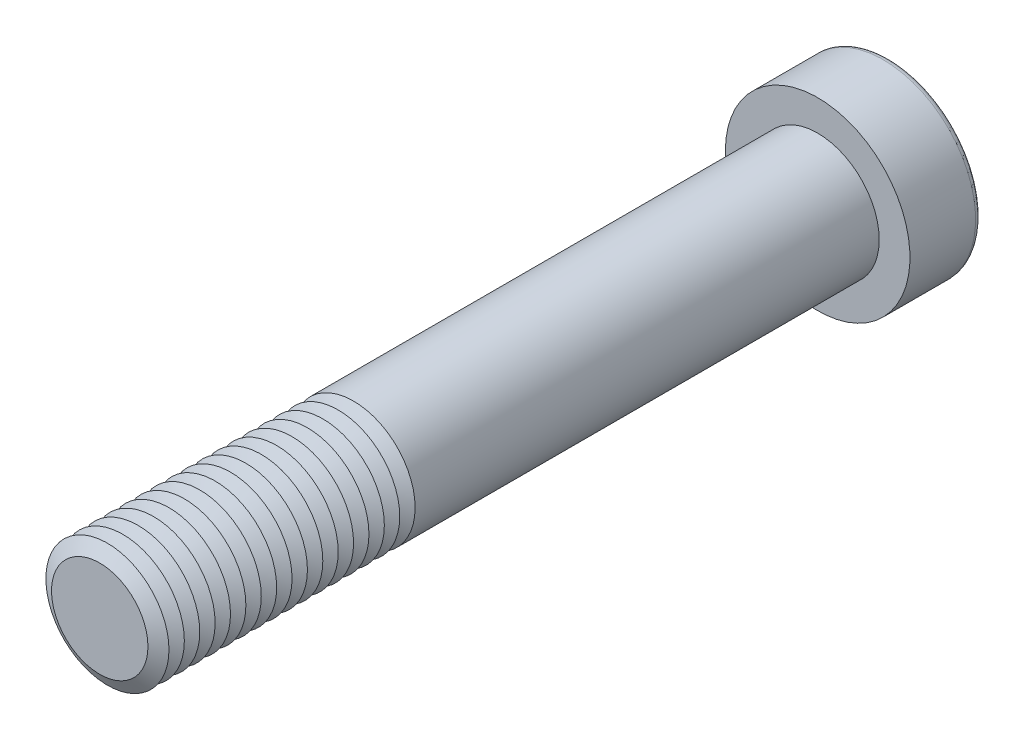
ISO-10303-21;
HEADER;
FILE_DESCRIPTION(('STEP AP214'),'2;1');
FILE_NAME('part.step','',(''),(''),'','','');
FILE_SCHEMA(('AUTOMOTIVE_DESIGN { 1 0 10303 214 1 1 1 1 }'));
ENDSEC;
DATA;
#1=APPLICATION_CONTEXT('core data for automotive mechanical design processes');
#2=APPLICATION_PROTOCOL_DEFINITION('international standard','automotive_design',2000,#1);
#3=PRODUCT_CONTEXT('',#1,'mechanical');
#4=PRODUCT('Part','Part','',(#3));
#5=PRODUCT_RELATED_PRODUCT_CATEGORY('part','',(#4));
#6=PRODUCT_DEFINITION_FORMATION('','',#4);
#7=PRODUCT_DEFINITION_CONTEXT('part definition',#1,'design');
#8=PRODUCT_DEFINITION('design','',#6,#7);
#9=PRODUCT_DEFINITION_SHAPE('','',#8);
#10=(LENGTH_UNIT() NAMED_UNIT(*) SI_UNIT(.MILLI.,.METRE.));
#11=(NAMED_UNIT(*) PLANE_ANGLE_UNIT() SI_UNIT($,.RADIAN.));
#12=(NAMED_UNIT(*) SI_UNIT($,.STERADIAN.) SOLID_ANGLE_UNIT());
#13=UNCERTAINTY_MEASURE_WITH_UNIT(LENGTH_MEASURE(1.E-05),#10,'distance_accuracy_value','');
#14=(GEOMETRIC_REPRESENTATION_CONTEXT(3) GLOBAL_UNCERTAINTY_ASSIGNED_CONTEXT((#13)) GLOBAL_UNIT_ASSIGNED_CONTEXT((#10,
#11,#12)) REPRESENTATION_CONTEXT('',''));
#15=CARTESIAN_POINT('',(0.,0.,0.));
#16=DIRECTION('',(0.,0.,1.));
#17=DIRECTION('',(1.,0.,0.));
#18=AXIS2_PLACEMENT_3D('',#15,#16,#17);
#19=CARTESIAN_POINT('',(0.,0.,129.5));
#20=DIRECTION('',(0.,0.,1.));
#21=DIRECTION('',(1.,0.,0.));
#22=AXIS2_PLACEMENT_3D('',#19,#20,#21);
#23=CONICAL_SURFACE('',#22,12.,1.0471975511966);
#24=CARTESIAN_POINT('',(0.,0.,128.));
#25=DIRECTION('',(0.,0.,1.));
#26=DIRECTION('',(1.,0.,0.));
#27=AXIS2_PLACEMENT_3D('',#24,#25,#26);
#28=CIRCLE('',#27,9.40192378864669);
#29=CARTESIAN_POINT('',(9.40192378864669,0.,128.));
#30=VERTEX_POINT('',#29);
#31=EDGE_CURVE('E313',#30,#30,#28,.T.);
#32=ORIENTED_EDGE('',*,*,#31,.T.);
#33=EDGE_LOOP('',(#32));
#34=FACE_BOUND('',#33,.T.);
#35=CARTESIAN_POINT('',(0.,0.,129.5));
#36=DIRECTION('',(0.,0.,1.));
#37=DIRECTION('',(1.,0.,0.));
#38=AXIS2_PLACEMENT_3D('',#35,#36,#37);
#39=CIRCLE('',#38,12.);
#40=CARTESIAN_POINT('',(12.,0.,129.5));
#41=VERTEX_POINT('',#40);
#42=EDGE_CURVE('E316',#41,#41,#39,.T.);
#43=ORIENTED_EDGE('',*,*,#42,.F.);
#44=EDGE_LOOP('',(#43));
#45=FACE_BOUND('',#44,.T.);
#46=ADVANCED_FACE('F39',(#34,#45),#23,.T.);
#47=CARTESIAN_POINT('',(0.,0.,128.));
#48=DIRECTION('',(0.,0.,-1.));
#49=DIRECTION('',(-1.,0.,0.));
#50=AXIS2_PLACEMENT_3D('',#47,#48,#49);
#51=CONICAL_SURFACE('',#50,9.40192378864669,1.0471975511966);
#52=CARTESIAN_POINT('',(0.,0.,126.5));
#53=DIRECTION('',(0.,0.,1.));
#54=DIRECTION('',(1.,0.,0.));
#55=AXIS2_PLACEMENT_3D('',#52,#53,#54);
#56=CIRCLE('',#55,12.);
#57=CARTESIAN_POINT('',(12.,0.,126.5));
#58=VERTEX_POINT('',#57);
#59=EDGE_CURVE('E324',#58,#58,#56,.T.);
#60=ORIENTED_EDGE('',*,*,#59,.T.);
#61=EDGE_LOOP('',(#60));
#62=FACE_BOUND('',#61,.T.);
#63=ORIENTED_EDGE('',*,*,#31,.F.);
#64=EDGE_LOOP('',(#63));
#65=FACE_BOUND('',#64,.T.);
#66=ADVANCED_FACE('F245',(#62,#65),#51,.T.);
#67=CARTESIAN_POINT('',(0.,0.,140.));
#68=DIRECTION('',(0.,0.,1.));
#69=DIRECTION('',(1.,0.,0.));
#70=AXIS2_PLACEMENT_3D('',#67,#68,#69);
#71=PLANE('',#70);
#72=CARTESIAN_POINT('',(0.,0.,140.));
#73=DIRECTION('',(0.,0.,1.));
#74=DIRECTION('',(1.,0.,0.));
#75=AXIS2_PLACEMENT_3D('',#72,#73,#74);
#76=CIRCLE('',#75,9.40192378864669);
#77=CARTESIAN_POINT('',(9.40192378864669,0.,140.));
#78=VERTEX_POINT('',#77);
#79=EDGE_CURVE('E174',#78,#78,#76,.T.);
#80=ORIENTED_EDGE('',*,*,#79,.T.);
#81=EDGE_LOOP('',(#80));
#82=FACE_BOUND('',#81,.T.);
#83=ADVANCED_FACE('F251',(#82),#71,.T.);
#84=CARTESIAN_POINT('',(0.,0.,140.));
#85=DIRECTION('',(0.,0.,-1.));
#86=DIRECTION('',(-1.,0.,0.));
#87=AXIS2_PLACEMENT_3D('',#84,#85,#86);
#88=CONICAL_SURFACE('',#87,9.40192378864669,1.0471975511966);
#89=CARTESIAN_POINT('',(0.,0.,138.5));
#90=DIRECTION('',(0.,0.,1.));
#91=DIRECTION('',(1.,0.,0.));
#92=AXIS2_PLACEMENT_3D('',#89,#90,#91);
#93=CIRCLE('',#92,12.);
#94=CARTESIAN_POINT('',(12.,0.,138.5));
#95=VERTEX_POINT('',#94);
#96=EDGE_CURVE('E291',#95,#95,#93,.T.);
#97=ORIENTED_EDGE('',*,*,#96,.T.);
#98=EDGE_LOOP('',(#97));
#99=FACE_BOUND('',#98,.T.);
#100=ORIENTED_EDGE('',*,*,#79,.F.);
#101=EDGE_LOOP('',(#100));
#102=FACE_BOUND('',#101,.T.);
#103=ADVANCED_FACE('F199',(#99,#102),#88,.T.);
#104=CARTESIAN_POINT('',(0.,0.,138.5));
#105=DIRECTION('',(0.,0.,1.));
#106=DIRECTION('',(1.,0.,0.));
#107=AXIS2_PLACEMENT_3D('',#104,#105,#106);
#108=CONICAL_SURFACE('',#107,12.,1.0471975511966);
#109=CARTESIAN_POINT('',(0.,0.,137.));
#110=DIRECTION('',(0.,0.,1.));
#111=DIRECTION('',(1.,0.,0.));
#112=AXIS2_PLACEMENT_3D('',#109,#110,#111);
#113=CIRCLE('',#112,9.40192378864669);
#114=CARTESIAN_POINT('',(9.40192378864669,0.,137.));
#115=VERTEX_POINT('',#114);
#116=EDGE_CURVE('E288',#115,#115,#113,.T.);
#117=ORIENTED_EDGE('',*,*,#116,.T.);
#118=EDGE_LOOP('',(#117));
#119=FACE_BOUND('',#118,.T.);
#120=ORIENTED_EDGE('',*,*,#96,.F.);
#121=EDGE_LOOP('',(#120));
#122=FACE_BOUND('',#121,.T.);
#123=ADVANCED_FACE('F277',(#119,#122),#108,.T.);
#124=CARTESIAN_POINT('',(0.,0.,137.));
#125=DIRECTION('',(0.,0.,-1.));
#126=DIRECTION('',(-1.,0.,0.));
#127=AXIS2_PLACEMENT_3D('',#124,#125,#126);
#128=CONICAL_SURFACE('',#127,9.40192378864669,1.0471975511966);
#129=CARTESIAN_POINT('',(0.,0.,135.5));
#130=DIRECTION('',(0.,0.,1.));
#131=DIRECTION('',(1.,0.,0.));
#132=AXIS2_PLACEMENT_3D('',#129,#130,#131);
#133=CIRCLE('',#132,12.);
#134=CARTESIAN_POINT('',(12.,0.,135.5));
#135=VERTEX_POINT('',#134);
#136=EDGE_CURVE('E299',#135,#135,#133,.T.);
#137=ORIENTED_EDGE('',*,*,#136,.T.);
#138=EDGE_LOOP('',(#137));
#139=FACE_BOUND('',#138,.T.);
#140=ORIENTED_EDGE('',*,*,#116,.F.);
#141=EDGE_LOOP('',(#140));
#142=FACE_BOUND('',#141,.T.);
#143=ADVANCED_FACE('F274',(#139,#142),#128,.T.);
#144=CARTESIAN_POINT('',(0.,0.,135.5));
#145=DIRECTION('',(0.,0.,1.));
#146=DIRECTION('',(1.,0.,0.));
#147=AXIS2_PLACEMENT_3D('',#144,#145,#146);
#148=CONICAL_SURFACE('',#147,12.,1.0471975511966);
#149=CARTESIAN_POINT('',(0.,0.,134.));
#150=DIRECTION('',(0.,0.,1.));
#151=DIRECTION('',(1.,0.,0.));
#152=AXIS2_PLACEMENT_3D('',#149,#150,#151);
#153=CIRCLE('',#152,9.40192378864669);
#154=CARTESIAN_POINT('',(9.40192378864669,0.,134.));
#155=VERTEX_POINT('',#154);
#156=EDGE_CURVE('E293',#155,#155,#153,.T.);
#157=ORIENTED_EDGE('',*,*,#156,.T.);
#158=EDGE_LOOP('',(#157));
#159=FACE_BOUND('',#158,.T.);
#160=ORIENTED_EDGE('',*,*,#136,.F.);
#161=EDGE_LOOP('',(#160));
#162=FACE_BOUND('',#161,.T.);
#163=ADVANCED_FACE('F270',(#159,#162),#148,.T.);
#164=CARTESIAN_POINT('',(0.,0.,134.));
#165=DIRECTION('',(0.,0.,-1.));
#166=DIRECTION('',(-1.,0.,0.));
#167=AXIS2_PLACEMENT_3D('',#164,#165,#166);
#168=CONICAL_SURFACE('',#167,9.40192378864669,1.0471975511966);
#169=CARTESIAN_POINT('',(0.,0.,132.5));
#170=DIRECTION('',(0.,0.,1.));
#171=DIRECTION('',(1.,0.,0.));
#172=AXIS2_PLACEMENT_3D('',#169,#170,#171);
#173=CIRCLE('',#172,12.);
#174=CARTESIAN_POINT('',(12.,0.,132.5));
#175=VERTEX_POINT('',#174);
#176=EDGE_CURVE('E309',#175,#175,#173,.T.);
#177=ORIENTED_EDGE('',*,*,#176,.T.);
#178=EDGE_LOOP('',(#177));
#179=FACE_BOUND('',#178,.T.);
#180=ORIENTED_EDGE('',*,*,#156,.F.);
#181=EDGE_LOOP('',(#180));
#182=FACE_BOUND('',#181,.T.);
#183=ADVANCED_FACE('F266',(#179,#182),#168,.T.);
#184=CARTESIAN_POINT('',(0.,0.,132.5));
#185=DIRECTION('',(0.,0.,1.));
#186=DIRECTION('',(1.,0.,0.));
#187=AXIS2_PLACEMENT_3D('',#184,#185,#186);
#188=CONICAL_SURFACE('',#187,12.,1.0471975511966);
#189=CARTESIAN_POINT('',(0.,0.,131.));
#190=DIRECTION('',(0.,0.,1.));
#191=DIRECTION('',(1.,0.,0.));
#192=AXIS2_PLACEMENT_3D('',#189,#190,#191);
#193=CIRCLE('',#192,9.40192378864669);
#194=CARTESIAN_POINT('',(9.40192378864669,0.,131.));
#195=VERTEX_POINT('',#194);
#196=EDGE_CURVE('E305',#195,#195,#193,.T.);
#197=ORIENTED_EDGE('',*,*,#196,.T.);
#198=EDGE_LOOP('',(#197));
#199=FACE_BOUND('',#198,.T.);
#200=ORIENTED_EDGE('',*,*,#176,.F.);
#201=EDGE_LOOP('',(#200));
#202=FACE_BOUND('',#201,.T.);
#203=ADVANCED_FACE('F262',(#199,#202),#188,.T.);
#204=CARTESIAN_POINT('',(0.,0.,131.));
#205=DIRECTION('',(0.,0.,-1.));
#206=DIRECTION('',(-1.,0.,0.));
#207=AXIS2_PLACEMENT_3D('',#204,#205,#206);
#208=CONICAL_SURFACE('',#207,9.40192378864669,1.0471975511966);
#209=ORIENTED_EDGE('',*,*,#42,.T.);
#210=EDGE_LOOP('',(#209));
#211=FACE_BOUND('',#210,.T.);
#212=ORIENTED_EDGE('',*,*,#196,.F.);
#213=EDGE_LOOP('',(#212));
#214=FACE_BOUND('',#213,.T.);
#215=ADVANCED_FACE('F258',(#211,#214),#208,.T.);
#216=CARTESIAN_POINT('',(0.,0.,126.5));
#217=DIRECTION('',(0.,0.,1.));
#218=DIRECTION('',(1.,0.,0.));
#219=AXIS2_PLACEMENT_3D('',#216,#217,#218);
#220=CONICAL_SURFACE('',#219,12.,1.0471975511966);
#221=CARTESIAN_POINT('',(0.,0.,125.));
#222=DIRECTION('',(0.,0.,1.));
#223=DIRECTION('',(1.,0.,0.));
#224=AXIS2_PLACEMENT_3D('',#221,#222,#223);
#225=CIRCLE('',#224,9.40192378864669);
#226=CARTESIAN_POINT('',(9.40192378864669,0.,125.));
#227=VERTEX_POINT('',#226);
#228=EDGE_CURVE('E320',#227,#227,#225,.T.);
#229=ORIENTED_EDGE('',*,*,#228,.T.);
#230=EDGE_LOOP('',(#229));
#231=FACE_BOUND('',#230,.T.);
#232=ORIENTED_EDGE('',*,*,#59,.F.);
#233=EDGE_LOOP('',(#232));
#234=FACE_BOUND('',#233,.T.);
#235=ADVANCED_FACE('F261',(#231,#234),#220,.T.);
#236=CARTESIAN_POINT('',(0.,0.,125.));
#237=DIRECTION('',(0.,0.,-1.));
#238=DIRECTION('',(-1.,0.,0.));
#239=AXIS2_PLACEMENT_3D('',#236,#237,#238);
#240=CONICAL_SURFACE('',#239,9.40192378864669,1.0471975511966);
#241=CARTESIAN_POINT('',(0.,0.,123.5));
#242=DIRECTION('',(0.,0.,1.));
#243=DIRECTION('',(1.,0.,0.));
#244=AXIS2_PLACEMENT_3D('',#241,#242,#243);
#245=CIRCLE('',#244,12.);
#246=CARTESIAN_POINT('',(12.,0.,123.5));
#247=VERTEX_POINT('',#246);
#248=EDGE_CURVE('E332',#247,#247,#245,.T.);
#249=ORIENTED_EDGE('',*,*,#248,.T.);
#250=EDGE_LOOP('',(#249));
#251=FACE_BOUND('',#250,.T.);
#252=ORIENTED_EDGE('',*,*,#228,.F.);
#253=EDGE_LOOP('',(#252));
#254=FACE_BOUND('',#253,.T.);
#255=ADVANCED_FACE('F511',(#251,#254),#240,.T.);
#256=CARTESIAN_POINT('',(0.,0.,123.5));
#257=DIRECTION('',(0.,0.,1.));
#258=DIRECTION('',(1.,0.,0.));
#259=AXIS2_PLACEMENT_3D('',#256,#257,#258);
#260=CONICAL_SURFACE('',#259,12.,1.0471975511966);
#261=CARTESIAN_POINT('',(0.,0.,122.));
#262=DIRECTION('',(0.,0.,1.));
#263=DIRECTION('',(1.,0.,0.));
#264=AXIS2_PLACEMENT_3D('',#261,#262,#263);
#265=CIRCLE('',#264,9.40192378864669);
#266=CARTESIAN_POINT('',(9.40192378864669,0.,122.));
#267=VERTEX_POINT('',#266);
#268=EDGE_CURVE('E328',#267,#267,#265,.T.);
#269=ORIENTED_EDGE('',*,*,#268,.T.);
#270=EDGE_LOOP('',(#269));
#271=FACE_BOUND('',#270,.T.);
#272=ORIENTED_EDGE('',*,*,#248,.F.);
#273=EDGE_LOOP('',(#272));
#274=FACE_BOUND('',#273,.T.);
#275=ADVANCED_FACE('F507',(#271,#274),#260,.T.);
#276=CARTESIAN_POINT('',(0.,0.,122.));
#277=DIRECTION('',(0.,0.,-1.));
#278=DIRECTION('',(-1.,0.,0.));
#279=AXIS2_PLACEMENT_3D('',#276,#277,#278);
#280=CONICAL_SURFACE('',#279,9.40192378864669,1.0471975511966);
#281=CARTESIAN_POINT('',(0.,0.,120.5));
#282=DIRECTION('',(0.,0.,1.));
#283=DIRECTION('',(1.,0.,0.));
#284=AXIS2_PLACEMENT_3D('',#281,#282,#283);
#285=CIRCLE('',#284,12.);
#286=CARTESIAN_POINT('',(12.,0.,120.5));
#287=VERTEX_POINT('',#286);
#288=EDGE_CURVE('E340',#287,#287,#285,.T.);
#289=ORIENTED_EDGE('',*,*,#288,.T.);
#290=EDGE_LOOP('',(#289));
#291=FACE_BOUND('',#290,.T.);
#292=ORIENTED_EDGE('',*,*,#268,.F.);
#293=EDGE_LOOP('',(#292));
#294=FACE_BOUND('',#293,.T.);
#295=ADVANCED_FACE('F503',(#291,#294),#280,.T.);
#296=CARTESIAN_POINT('',(0.,0.,120.5));
#297=DIRECTION('',(0.,0.,1.));
#298=DIRECTION('',(1.,0.,0.));
#299=AXIS2_PLACEMENT_3D('',#296,#297,#298);
#300=CONICAL_SURFACE('',#299,12.,1.0471975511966);
#301=CARTESIAN_POINT('',(0.,0.,119.));
#302=DIRECTION('',(0.,0.,1.));
#303=DIRECTION('',(1.,0.,0.));
#304=AXIS2_PLACEMENT_3D('',#301,#302,#303);
#305=CIRCLE('',#304,9.40192378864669);
#306=CARTESIAN_POINT('',(9.40192378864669,0.,119.));
#307=VERTEX_POINT('',#306);
#308=EDGE_CURVE('E336',#307,#307,#305,.T.);
#309=ORIENTED_EDGE('',*,*,#308,.T.);
#310=EDGE_LOOP('',(#309));
#311=FACE_BOUND('',#310,.T.);
#312=ORIENTED_EDGE('',*,*,#288,.F.);
#313=EDGE_LOOP('',(#312));
#314=FACE_BOUND('',#313,.T.);
#315=ADVANCED_FACE('F499',(#311,#314),#300,.T.);
#316=CARTESIAN_POINT('',(0.,0.,119.));
#317=DIRECTION('',(0.,0.,-1.));
#318=DIRECTION('',(-1.,0.,0.));
#319=AXIS2_PLACEMENT_3D('',#316,#317,#318);
#320=CONICAL_SURFACE('',#319,9.40192378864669,1.0471975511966);
#321=CARTESIAN_POINT('',(0.,0.,117.5));
#322=DIRECTION('',(0.,0.,1.));
#323=DIRECTION('',(1.,0.,0.));
#324=AXIS2_PLACEMENT_3D('',#321,#322,#323);
#325=CIRCLE('',#324,12.);
#326=CARTESIAN_POINT('',(12.,0.,117.5));
#327=VERTEX_POINT('',#326);
#328=EDGE_CURVE('E347',#327,#327,#325,.T.);
#329=ORIENTED_EDGE('',*,*,#328,.T.);
#330=EDGE_LOOP('',(#329));
#331=FACE_BOUND('',#330,.T.);
#332=ORIENTED_EDGE('',*,*,#308,.F.);
#333=EDGE_LOOP('',(#332));
#334=FACE_BOUND('',#333,.T.);
#335=ADVANCED_FACE('F495',(#331,#334),#320,.T.);
#336=CARTESIAN_POINT('',(0.,0.,117.5));
#337=DIRECTION('',(0.,0.,1.));
#338=DIRECTION('',(1.,0.,0.));
#339=AXIS2_PLACEMENT_3D('',#336,#337,#338);
#340=CONICAL_SURFACE('',#339,12.,1.0471975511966);
#341=CARTESIAN_POINT('',(0.,0.,116.));
#342=DIRECTION('',(0.,0.,1.));
#343=DIRECTION('',(1.,0.,0.));
#344=AXIS2_PLACEMENT_3D('',#341,#342,#343);
#345=CIRCLE('',#344,9.40192378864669);
#346=CARTESIAN_POINT('',(9.40192378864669,0.,116.));
#347=VERTEX_POINT('',#346);
#348=EDGE_CURVE('E344',#347,#347,#345,.T.);
#349=ORIENTED_EDGE('',*,*,#348,.T.);
#350=EDGE_LOOP('',(#349));
#351=FACE_BOUND('',#350,.T.);
#352=ORIENTED_EDGE('',*,*,#328,.F.);
#353=EDGE_LOOP('',(#352));
#354=FACE_BOUND('',#353,.T.);
#355=ADVANCED_FACE('F491',(#351,#354),#340,.T.);
#356=CARTESIAN_POINT('',(0.,0.,116.));
#357=DIRECTION('',(0.,0.,-1.));
#358=DIRECTION('',(-1.,0.,0.));
#359=AXIS2_PLACEMENT_3D('',#356,#357,#358);
#360=CONICAL_SURFACE('',#359,9.40192378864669,1.0471975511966);
#361=CARTESIAN_POINT('',(0.,0.,114.5));
#362=DIRECTION('',(0.,0.,1.));
#363=DIRECTION('',(1.,0.,0.));
#364=AXIS2_PLACEMENT_3D('',#361,#362,#363);
#365=CIRCLE('',#364,12.);
#366=CARTESIAN_POINT('',(12.,0.,114.5));
#367=VERTEX_POINT('',#366);
#368=EDGE_CURVE('E354',#367,#367,#365,.T.);
#369=ORIENTED_EDGE('',*,*,#368,.T.);
#370=EDGE_LOOP('',(#369));
#371=FACE_BOUND('',#370,.T.);
#372=ORIENTED_EDGE('',*,*,#348,.F.);
#373=EDGE_LOOP('',(#372));
#374=FACE_BOUND('',#373,.T.);
#375=ADVANCED_FACE('F487',(#371,#374),#360,.T.);
#376=CARTESIAN_POINT('',(0.,0.,114.5));
#377=DIRECTION('',(0.,0.,1.));
#378=DIRECTION('',(1.,0.,0.));
#379=AXIS2_PLACEMENT_3D('',#376,#377,#378);
#380=CONICAL_SURFACE('',#379,12.,1.0471975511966);
#381=CARTESIAN_POINT('',(0.,0.,113.));
#382=DIRECTION('',(0.,0.,1.));
#383=DIRECTION('',(1.,0.,0.));
#384=AXIS2_PLACEMENT_3D('',#381,#382,#383);
#385=CIRCLE('',#384,9.40192378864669);
#386=CARTESIAN_POINT('',(9.40192378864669,0.,113.));
#387=VERTEX_POINT('',#386);
#388=EDGE_CURVE('E350',#387,#387,#385,.T.);
#389=ORIENTED_EDGE('',*,*,#388,.T.);
#390=EDGE_LOOP('',(#389));
#391=FACE_BOUND('',#390,.T.);
#392=ORIENTED_EDGE('',*,*,#368,.F.);
#393=EDGE_LOOP('',(#392));
#394=FACE_BOUND('',#393,.T.);
#395=ADVANCED_FACE('F483',(#391,#394),#380,.T.);
#396=CARTESIAN_POINT('',(0.,0.,113.));
#397=DIRECTION('',(0.,0.,-1.));
#398=DIRECTION('',(-1.,0.,0.));
#399=AXIS2_PLACEMENT_3D('',#396,#397,#398);
#400=CONICAL_SURFACE('',#399,9.40192378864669,1.0471975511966);
#401=CARTESIAN_POINT('',(0.,0.,111.5));
#402=DIRECTION('',(0.,0.,1.));
#403=DIRECTION('',(1.,0.,0.));
#404=AXIS2_PLACEMENT_3D('',#401,#402,#403);
#405=CIRCLE('',#404,12.);
#406=CARTESIAN_POINT('',(12.,0.,111.5));
#407=VERTEX_POINT('',#406);
#408=EDGE_CURVE('E362',#407,#407,#405,.T.);
#409=ORIENTED_EDGE('',*,*,#408,.T.);
#410=EDGE_LOOP('',(#409));
#411=FACE_BOUND('',#410,.T.);
#412=ORIENTED_EDGE('',*,*,#388,.F.);
#413=EDGE_LOOP('',(#412));
#414=FACE_BOUND('',#413,.T.);
#415=ADVANCED_FACE('F479',(#411,#414),#400,.T.);
#416=CARTESIAN_POINT('',(0.,0.,111.5));
#417=DIRECTION('',(0.,0.,1.));
#418=DIRECTION('',(1.,0.,0.));
#419=AXIS2_PLACEMENT_3D('',#416,#417,#418);
#420=CONICAL_SURFACE('',#419,12.,1.0471975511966);
#421=CARTESIAN_POINT('',(0.,0.,110.));
#422=DIRECTION('',(0.,0.,1.));
#423=DIRECTION('',(1.,0.,0.));
#424=AXIS2_PLACEMENT_3D('',#421,#422,#423);
#425=CIRCLE('',#424,9.40192378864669);
#426=CARTESIAN_POINT('',(9.40192378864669,0.,110.));
#427=VERTEX_POINT('',#426);
#428=EDGE_CURVE('E358',#427,#427,#425,.T.);
#429=ORIENTED_EDGE('',*,*,#428,.T.);
#430=EDGE_LOOP('',(#429));
#431=FACE_BOUND('',#430,.T.);
#432=ORIENTED_EDGE('',*,*,#408,.F.);
#433=EDGE_LOOP('',(#432));
#434=FACE_BOUND('',#433,.T.);
#435=ADVANCED_FACE('F475',(#431,#434),#420,.T.);
#436=CARTESIAN_POINT('',(0.,0.,110.));
#437=DIRECTION('',(0.,0.,-1.));
#438=DIRECTION('',(-1.,0.,0.));
#439=AXIS2_PLACEMENT_3D('',#436,#437,#438);
#440=CONICAL_SURFACE('',#439,9.40192378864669,1.0471975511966);
#441=CARTESIAN_POINT('',(0.,0.,108.5));
#442=DIRECTION('',(0.,0.,1.));
#443=DIRECTION('',(1.,0.,0.));
#444=AXIS2_PLACEMENT_3D('',#441,#442,#443);
#445=CIRCLE('',#444,12.);
#446=CARTESIAN_POINT('',(12.,0.,108.5));
#447=VERTEX_POINT('',#446);
#448=EDGE_CURVE('E370',#447,#447,#445,.T.);
#449=ORIENTED_EDGE('',*,*,#448,.T.);
#450=EDGE_LOOP('',(#449));
#451=FACE_BOUND('',#450,.T.);
#452=ORIENTED_EDGE('',*,*,#428,.F.);
#453=EDGE_LOOP('',(#452));
#454=FACE_BOUND('',#453,.T.);
#455=ADVANCED_FACE('F471',(#451,#454),#440,.T.);
#456=CARTESIAN_POINT('',(0.,0.,108.5));
#457=DIRECTION('',(0.,0.,1.));
#458=DIRECTION('',(1.,0.,0.));
#459=AXIS2_PLACEMENT_3D('',#456,#457,#458);
#460=CONICAL_SURFACE('',#459,12.,1.0471975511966);
#461=CARTESIAN_POINT('',(0.,0.,107.));
#462=DIRECTION('',(0.,0.,1.));
#463=DIRECTION('',(1.,0.,0.));
#464=AXIS2_PLACEMENT_3D('',#461,#462,#463);
#465=CIRCLE('',#464,9.40192378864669);
#466=CARTESIAN_POINT('',(9.40192378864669,0.,107.));
#467=VERTEX_POINT('',#466);
#468=EDGE_CURVE('E366',#467,#467,#465,.T.);
#469=ORIENTED_EDGE('',*,*,#468,.T.);
#470=EDGE_LOOP('',(#469));
#471=FACE_BOUND('',#470,.T.);
#472=ORIENTED_EDGE('',*,*,#448,.F.);
#473=EDGE_LOOP('',(#472));
#474=FACE_BOUND('',#473,.T.);
#475=ADVANCED_FACE('F467',(#471,#474),#460,.T.);
#476=CARTESIAN_POINT('',(0.,0.,107.));
#477=DIRECTION('',(0.,0.,-1.));
#478=DIRECTION('',(-1.,0.,0.));
#479=AXIS2_PLACEMENT_3D('',#476,#477,#478);
#480=CONICAL_SURFACE('',#479,9.40192378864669,1.0471975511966);
#481=CARTESIAN_POINT('',(0.,0.,105.5));
#482=DIRECTION('',(0.,0.,1.));
#483=DIRECTION('',(1.,0.,0.));
#484=AXIS2_PLACEMENT_3D('',#481,#482,#483);
#485=CIRCLE('',#484,12.);
#486=CARTESIAN_POINT('',(12.,0.,105.5));
#487=VERTEX_POINT('',#486);
#488=EDGE_CURVE('E378',#487,#487,#485,.T.);
#489=ORIENTED_EDGE('',*,*,#488,.T.);
#490=EDGE_LOOP('',(#489));
#491=FACE_BOUND('',#490,.T.);
#492=ORIENTED_EDGE('',*,*,#468,.F.);
#493=EDGE_LOOP('',(#492));
#494=FACE_BOUND('',#493,.T.);
#495=ADVANCED_FACE('F463',(#491,#494),#480,.T.);
#496=CARTESIAN_POINT('',(0.,0.,105.5));
#497=DIRECTION('',(0.,0.,1.));
#498=DIRECTION('',(1.,0.,0.));
#499=AXIS2_PLACEMENT_3D('',#496,#497,#498);
#500=CONICAL_SURFACE('',#499,12.,1.0471975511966);
#501=CARTESIAN_POINT('',(0.,0.,104.));
#502=DIRECTION('',(0.,0.,1.));
#503=DIRECTION('',(1.,0.,0.));
#504=AXIS2_PLACEMENT_3D('',#501,#502,#503);
#505=CIRCLE('',#504,9.40192378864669);
#506=CARTESIAN_POINT('',(9.40192378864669,0.,104.));
#507=VERTEX_POINT('',#506);
#508=EDGE_CURVE('E374',#507,#507,#505,.T.);
#509=ORIENTED_EDGE('',*,*,#508,.T.);
#510=EDGE_LOOP('',(#509));
#511=FACE_BOUND('',#510,.T.);
#512=ORIENTED_EDGE('',*,*,#488,.F.);
#513=EDGE_LOOP('',(#512));
#514=FACE_BOUND('',#513,.T.);
#515=ADVANCED_FACE('F459',(#511,#514),#500,.T.);
#516=CARTESIAN_POINT('',(0.,0.,104.));
#517=DIRECTION('',(0.,0.,-1.));
#518=DIRECTION('',(-1.,0.,0.));
#519=AXIS2_PLACEMENT_3D('',#516,#517,#518);
#520=CONICAL_SURFACE('',#519,9.40192378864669,1.0471975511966);
#521=CARTESIAN_POINT('',(0.,0.,102.5));
#522=DIRECTION('',(0.,0.,1.));
#523=DIRECTION('',(1.,0.,0.));
#524=AXIS2_PLACEMENT_3D('',#521,#522,#523);
#525=CIRCLE('',#524,12.);
#526=CARTESIAN_POINT('',(12.,0.,102.5));
#527=VERTEX_POINT('',#526);
#528=EDGE_CURVE('E386',#527,#527,#525,.T.);
#529=ORIENTED_EDGE('',*,*,#528,.T.);
#530=EDGE_LOOP('',(#529));
#531=FACE_BOUND('',#530,.T.);
#532=ORIENTED_EDGE('',*,*,#508,.F.);
#533=EDGE_LOOP('',(#532));
#534=FACE_BOUND('',#533,.T.);
#535=ADVANCED_FACE('F455',(#531,#534),#520,.T.);
#536=CARTESIAN_POINT('',(0.,0.,102.5));
#537=DIRECTION('',(0.,0.,1.));
#538=DIRECTION('',(1.,0.,0.));
#539=AXIS2_PLACEMENT_3D('',#536,#537,#538);
#540=CONICAL_SURFACE('',#539,12.,1.0471975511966);
#541=CARTESIAN_POINT('',(0.,0.,101.));
#542=DIRECTION('',(0.,0.,1.));
#543=DIRECTION('',(1.,0.,0.));
#544=AXIS2_PLACEMENT_3D('',#541,#542,#543);
#545=CIRCLE('',#544,9.40192378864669);
#546=CARTESIAN_POINT('',(9.40192378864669,0.,101.));
#547=VERTEX_POINT('',#546);
#548=EDGE_CURVE('E382',#547,#547,#545,.T.);
#549=ORIENTED_EDGE('',*,*,#548,.T.);
#550=EDGE_LOOP('',(#549));
#551=FACE_BOUND('',#550,.T.);
#552=ORIENTED_EDGE('',*,*,#528,.F.);
#553=EDGE_LOOP('',(#552));
#554=FACE_BOUND('',#553,.T.);
#555=ADVANCED_FACE('F451',(#551,#554),#540,.T.);
#556=CARTESIAN_POINT('',(0.,0.,101.));
#557=DIRECTION('',(0.,0.,-1.));
#558=DIRECTION('',(-1.,0.,0.));
#559=AXIS2_PLACEMENT_3D('',#556,#557,#558);
#560=CONICAL_SURFACE('',#559,9.40192378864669,1.0471975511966);
#561=CARTESIAN_POINT('',(0.,0.,99.5));
#562=DIRECTION('',(0.,0.,1.));
#563=DIRECTION('',(1.,0.,0.));
#564=AXIS2_PLACEMENT_3D('',#561,#562,#563);
#565=CIRCLE('',#564,12.);
#566=CARTESIAN_POINT('',(12.,0.,99.5));
#567=VERTEX_POINT('',#566);
#568=EDGE_CURVE('E394',#567,#567,#565,.T.);
#569=ORIENTED_EDGE('',*,*,#568,.T.);
#570=EDGE_LOOP('',(#569));
#571=FACE_BOUND('',#570,.T.);
#572=ORIENTED_EDGE('',*,*,#548,.F.);
#573=EDGE_LOOP('',(#572));
#574=FACE_BOUND('',#573,.T.);
#575=ADVANCED_FACE('F447',(#571,#574),#560,.T.);
#576=CARTESIAN_POINT('',(0.,0.,99.5));
#577=DIRECTION('',(0.,0.,1.));
#578=DIRECTION('',(1.,0.,0.));
#579=AXIS2_PLACEMENT_3D('',#576,#577,#578);
#580=CONICAL_SURFACE('',#579,12.,1.0471975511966);
#581=CARTESIAN_POINT('',(0.,0.,98.));
#582=DIRECTION('',(0.,0.,1.));
#583=DIRECTION('',(1.,0.,0.));
#584=AXIS2_PLACEMENT_3D('',#581,#582,#583);
#585=CIRCLE('',#584,9.40192378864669);
#586=CARTESIAN_POINT('',(9.40192378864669,0.,98.));
#587=VERTEX_POINT('',#586);
#588=EDGE_CURVE('E390',#587,#587,#585,.T.);
#589=ORIENTED_EDGE('',*,*,#588,.T.);
#590=EDGE_LOOP('',(#589));
#591=FACE_BOUND('',#590,.T.);
#592=ORIENTED_EDGE('',*,*,#568,.F.);
#593=EDGE_LOOP('',(#592));
#594=FACE_BOUND('',#593,.T.);
#595=ADVANCED_FACE('F443',(#591,#594),#580,.T.);
#596=CARTESIAN_POINT('',(0.,0.,98.));
#597=DIRECTION('',(0.,0.,-1.));
#598=DIRECTION('',(-1.,0.,0.));
#599=AXIS2_PLACEMENT_3D('',#596,#597,#598);
#600=CONICAL_SURFACE('',#599,9.40192378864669,1.0471975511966);
#601=CARTESIAN_POINT('',(0.,0.,96.5));
#602=DIRECTION('',(0.,0.,1.));
#603=DIRECTION('',(1.,0.,0.));
#604=AXIS2_PLACEMENT_3D('',#601,#602,#603);
#605=CIRCLE('',#604,12.);
#606=CARTESIAN_POINT('',(12.,0.,96.5));
#607=VERTEX_POINT('',#606);
#608=EDGE_CURVE('E402',#607,#607,#605,.T.);
#609=ORIENTED_EDGE('',*,*,#608,.T.);
#610=EDGE_LOOP('',(#609));
#611=FACE_BOUND('',#610,.T.);
#612=ORIENTED_EDGE('',*,*,#588,.F.);
#613=EDGE_LOOP('',(#612));
#614=FACE_BOUND('',#613,.T.);
#615=ADVANCED_FACE('F439',(#611,#614),#600,.T.);
#616=CARTESIAN_POINT('',(0.,0.,96.5));
#617=DIRECTION('',(0.,0.,1.));
#618=DIRECTION('',(1.,0.,0.));
#619=AXIS2_PLACEMENT_3D('',#616,#617,#618);
#620=CONICAL_SURFACE('',#619,12.,1.0471975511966);
#621=CARTESIAN_POINT('',(0.,0.,95.));
#622=DIRECTION('',(0.,0.,1.));
#623=DIRECTION('',(1.,0.,0.));
#624=AXIS2_PLACEMENT_3D('',#621,#622,#623);
#625=CIRCLE('',#624,9.40192378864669);
#626=CARTESIAN_POINT('',(9.40192378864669,0.,95.));
#627=VERTEX_POINT('',#626);
#628=EDGE_CURVE('E398',#627,#627,#625,.T.);
#629=ORIENTED_EDGE('',*,*,#628,.T.);
#630=EDGE_LOOP('',(#629));
#631=FACE_BOUND('',#630,.T.);
#632=ORIENTED_EDGE('',*,*,#608,.F.);
#633=EDGE_LOOP('',(#632));
#634=FACE_BOUND('',#633,.T.);
#635=ADVANCED_FACE('F434',(#631,#634),#620,.T.);
#636=CARTESIAN_POINT('',(0.,0.,95.));
#637=DIRECTION('',(0.,0.,-1.));
#638=DIRECTION('',(-1.,0.,0.));
#639=AXIS2_PLACEMENT_3D('',#636,#637,#638);
#640=CONICAL_SURFACE('',#639,9.40192378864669,1.0471975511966);
#641=CARTESIAN_POINT('',(0.,0.,93.5));
#642=DIRECTION('',(0.,0.,1.));
#643=DIRECTION('',(1.,0.,0.));
#644=AXIS2_PLACEMENT_3D('',#641,#642,#643);
#645=CIRCLE('',#644,12.);
#646=CARTESIAN_POINT('',(12.,0.,93.5));
#647=VERTEX_POINT('',#646);
#648=EDGE_CURVE('E414',#647,#647,#645,.T.);
#649=ORIENTED_EDGE('',*,*,#648,.T.);
#650=EDGE_LOOP('',(#649));
#651=FACE_BOUND('',#650,.T.);
#652=ORIENTED_EDGE('',*,*,#628,.F.);
#653=EDGE_LOOP('',(#652));
#654=FACE_BOUND('',#653,.T.);
#655=ADVANCED_FACE('F420',(#651,#654),#640,.T.);
#656=CARTESIAN_POINT('',(0.,0.,93.5));
#657=DIRECTION('',(0.,0.,1.));
#658=DIRECTION('',(1.,0.,0.));
#659=AXIS2_PLACEMENT_3D('',#656,#657,#658);
#660=CONICAL_SURFACE('',#659,12.,1.0471975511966);
#661=CARTESIAN_POINT('',(0.,0.,92.));
#662=DIRECTION('',(0.,0.,1.));
#663=DIRECTION('',(1.,0.,0.));
#664=AXIS2_PLACEMENT_3D('',#661,#662,#663);
#665=CIRCLE('',#664,9.40192378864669);
#666=CARTESIAN_POINT('',(9.40192378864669,0.,92.));
#667=VERTEX_POINT('',#666);
#668=EDGE_CURVE('E406',#667,#667,#665,.T.);
#669=ORIENTED_EDGE('',*,*,#668,.T.);
#670=EDGE_LOOP('',(#669));
#671=FACE_BOUND('',#670,.T.);
#672=ORIENTED_EDGE('',*,*,#648,.F.);
#673=EDGE_LOOP('',(#672));
#674=FACE_BOUND('',#673,.T.);
#675=ADVANCED_FACE('F423',(#671,#674),#660,.T.);
#676=CARTESIAN_POINT('',(0.,0.,92.));
#677=DIRECTION('',(0.,0.,-1.));
#678=DIRECTION('',(-1.,0.,0.));
#679=AXIS2_PLACEMENT_3D('',#676,#677,#678);
#680=CONICAL_SURFACE('',#679,9.40192378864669,1.0471975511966);
#681=CARTESIAN_POINT('',(0.,0.,90.5));
#682=DIRECTION('',(0.,0.,1.));
#683=DIRECTION('',(1.,0.,0.));
#684=AXIS2_PLACEMENT_3D('',#681,#682,#683);
#685=CIRCLE('',#684,12.);
#686=CARTESIAN_POINT('',(12.,0.,90.5));
#687=VERTEX_POINT('',#686);
#688=EDGE_CURVE('E410',#687,#687,#685,.T.);
#689=ORIENTED_EDGE('',*,*,#688,.T.);
#690=EDGE_LOOP('',(#689));
#691=FACE_BOUND('',#690,.T.);
#692=ORIENTED_EDGE('',*,*,#668,.F.);
#693=EDGE_LOOP('',(#692));
#694=FACE_BOUND('',#693,.T.);
#695=ADVANCED_FACE('F425',(#691,#694),#680,.T.);
#696=CARTESIAN_POINT('',(0.,0.,0.25));
#697=DIRECTION('',(0.,0.,-1.));
#698=DIRECTION('',(-1.,0.,0.));
#699=AXIS2_PLACEMENT_3D('',#696,#697,#698);
#700=CONICAL_SURFACE('',#699,9.5,1.0471975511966);
#701=CARTESIAN_POINT('',(0.,0.,5.73482755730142));
#702=VERTEX_POINT('',#701);
#703=VERTEX_LOOP('',#702);
#704=FACE_BOUND('',#703,.T.);
#705=CARTESIAN_POINT('',(0.,0.,0.25));
#706=DIRECTION('',(0.,0.,-1.));
#707=DIRECTION('',(-1.,0.,0.));
#708=AXIS2_PLACEMENT_3D('',#705,#706,#707);
#709=CIRCLE('',#708,9.5);
#710=CARTESIAN_POINT('',(-8.22724133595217,4.75,0.25));
#711=VERTEX_POINT('',#710);
#712=CARTESIAN_POINT('',(0.,9.5,0.25));
#713=VERTEX_POINT('',#712);
#714=EDGE_CURVE('E149',#711,#713,#709,.T.);
#715=ORIENTED_EDGE('',*,*,#714,.T.);
#716=CARTESIAN_POINT('',(0.,0.,0.25));
#717=DIRECTION('',(0.,0.,-1.));
#718=DIRECTION('',(-1.,0.,0.));
#719=AXIS2_PLACEMENT_3D('',#716,#717,#718);
#720=CIRCLE('',#719,9.5);
#721=CARTESIAN_POINT('',(8.22724133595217,4.75,0.25));
#722=VERTEX_POINT('',#721);
#723=EDGE_CURVE('E54',#713,#722,#720,.T.);
#724=ORIENTED_EDGE('',*,*,#723,.T.);
#725=CARTESIAN_POINT('',(8.22724133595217,-4.75,0.25));
#726=VERTEX_POINT('',#725);
#727=EDGE_CURVE('E1026',#722,#726,#720,.T.);
#728=ORIENTED_EDGE('',*,*,#727,.T.);
#729=CARTESIAN_POINT('',(0.,-9.5,0.25));
#730=VERTEX_POINT('',#729);
#731=EDGE_CURVE('E1024',#726,#730,#720,.T.);
#732=ORIENTED_EDGE('',*,*,#731,.T.);
#733=CARTESIAN_POINT('',(-8.22724133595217,-4.75,0.25));
#734=VERTEX_POINT('',#733);
#735=EDGE_CURVE('E1018',#730,#734,#720,.T.);
#736=ORIENTED_EDGE('',*,*,#735,.T.);
#737=EDGE_CURVE('E1016',#734,#711,#720,.T.);
#738=ORIENTED_EDGE('',*,*,#737,.T.);
#739=EDGE_LOOP('',(#715,#724,#728,#732,#736,#738));
#740=FACE_BOUND('',#739,.T.);
#741=ADVANCED_FACE('F201',(#704,#740),#700,.F.);
#742=CARTESIAN_POINT('',(0.,0.,0.25));
#743=DIRECTION('',(0.,0.,-1.));
#744=DIRECTION('',(-1.,0.,0.));
#745=AXIS2_PLACEMENT_3D('',#742,#743,#744);
#746=PLANE('',#745);
#747=ORIENTED_EDGE('',*,*,#723,.F.);
#748=DIRECTION('',(1.,0.,0.));
#749=VECTOR('',#748,1.);
#750=CARTESIAN_POINT('',(-5.48482755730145,9.5,0.25));
#751=LINE('',#750,#749);
#752=CARTESIAN_POINT('',(5.48482755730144,9.5,0.25));
#753=VERTEX_POINT('',#752);
#754=EDGE_CURVE('E1069',#713,#753,#751,.T.);
#755=ORIENTED_EDGE('',*,*,#754,.T.);
#756=DIRECTION('',(0.5,-0.866025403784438,0.));
#757=VECTOR('',#756,1.);
#758=CARTESIAN_POINT('',(5.48482755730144,9.5,0.25));
#759=LINE('',#758,#757);
#760=EDGE_CURVE('E155',#753,#722,#759,.T.);
#761=ORIENTED_EDGE('',*,*,#760,.T.);
#762=EDGE_LOOP('',(#747,#755,#761));
#763=FACE_BOUND('',#762,.T.);
#764=ADVANCED_FACE('F606',(#763),#746,.T.);
#765=ORIENTED_EDGE('',*,*,#727,.F.);
#766=CARTESIAN_POINT('',(10.9696551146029,0.,0.25));
#767=VERTEX_POINT('',#766);
#768=EDGE_CURVE('E1063',#722,#767,#759,.T.);
#769=ORIENTED_EDGE('',*,*,#768,.T.);
#770=DIRECTION('',(-0.5,-0.866025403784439,0.));
#771=VECTOR('',#770,1.);
#772=CARTESIAN_POINT('',(10.9696551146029,0.,0.25));
#773=LINE('',#772,#771);
#774=EDGE_CURVE('E1039',#767,#726,#773,.T.);
#775=ORIENTED_EDGE('',*,*,#774,.T.);
#776=EDGE_LOOP('',(#765,#769,#775));
#777=FACE_BOUND('',#776,.T.);
#778=ADVANCED_FACE('F616',(#777),#746,.T.);
#779=ORIENTED_EDGE('',*,*,#731,.F.);
#780=CARTESIAN_POINT('',(5.48482755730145,-9.5,0.25));
#781=VERTEX_POINT('',#780);
#782=EDGE_CURVE('E1041',#726,#781,#773,.T.);
#783=ORIENTED_EDGE('',*,*,#782,.T.);
#784=DIRECTION('',(-1.,0.,0.));
#785=VECTOR('',#784,1.);
#786=CARTESIAN_POINT('',(5.48482755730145,-9.5,0.25));
#787=LINE('',#786,#785);
#788=EDGE_CURVE('E993',#781,#730,#787,.T.);
#789=ORIENTED_EDGE('',*,*,#788,.T.);
#790=EDGE_LOOP('',(#779,#783,#789));
#791=FACE_BOUND('',#790,.T.);
#792=ADVANCED_FACE('F626',(#791),#746,.T.);
#793=ORIENTED_EDGE('',*,*,#735,.F.);
#794=CARTESIAN_POINT('',(-5.48482755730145,-9.5,0.25));
#795=VERTEX_POINT('',#794);
#796=EDGE_CURVE('E1036',#730,#795,#787,.T.);
#797=ORIENTED_EDGE('',*,*,#796,.T.);
#798=DIRECTION('',(-0.5,0.866025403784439,0.));
#799=VECTOR('',#798,1.);
#800=CARTESIAN_POINT('',(-5.48482755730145,-9.5,0.25));
#801=LINE('',#800,#799);
#802=EDGE_CURVE('E1038',#795,#734,#801,.T.);
#803=ORIENTED_EDGE('',*,*,#802,.T.);
#804=EDGE_LOOP('',(#793,#797,#803));
#805=FACE_BOUND('',#804,.T.);
#806=ADVANCED_FACE('F634',(#805),#746,.T.);
#807=ORIENTED_EDGE('',*,*,#737,.F.);
#808=CARTESIAN_POINT('',(-10.9696551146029,0.,0.25));
#809=VERTEX_POINT('',#808);
#810=EDGE_CURVE('E1043',#734,#809,#801,.T.);
#811=ORIENTED_EDGE('',*,*,#810,.T.);
#812=DIRECTION('',(0.5,0.866025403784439,0.));
#813=VECTOR('',#812,1.);
#814=CARTESIAN_POINT('',(-10.9696551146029,0.,0.25));
#815=LINE('',#814,#813);
#816=EDGE_CURVE('E158',#809,#711,#815,.T.);
#817=ORIENTED_EDGE('',*,*,#816,.T.);
#818=EDGE_LOOP('',(#807,#811,#817));
#819=FACE_BOUND('',#818,.T.);
#820=ADVANCED_FACE('F231',(#819),#746,.T.);
#821=ORIENTED_EDGE('',*,*,#714,.F.);
#822=CARTESIAN_POINT('',(-5.48482755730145,9.5,0.25));
#823=VERTEX_POINT('',#822);
#824=EDGE_CURVE('E1050',#711,#823,#815,.T.);
#825=ORIENTED_EDGE('',*,*,#824,.T.);
#826=EDGE_CURVE('E1065',#823,#713,#751,.T.);
#827=ORIENTED_EDGE('',*,*,#826,.T.);
#828=EDGE_LOOP('',(#821,#825,#827));
#829=FACE_BOUND('',#828,.T.);
#830=ADVANCED_FACE('F618',(#829),#746,.T.);
#831=CARTESIAN_POINT('',(-5.48482755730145,9.5,0.25));
#832=DIRECTION('',(0.,1.,0.));
#833=DIRECTION('',(0.,0.,1.));
#834=AXIS2_PLACEMENT_3D('',#831,#832,#833);
#835=PLANE('',#834);
#836=DIRECTION('',(0.,0.,-1.));
#837=VECTOR('',#836,1.);
#838=CARTESIAN_POINT('',(-5.48482755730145,9.5,0.25));
#839=LINE('',#838,#837);
#840=CARTESIAN_POINT('',(-5.48482755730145,9.5,-14.));
#841=VERTEX_POINT('',#840);
#842=EDGE_CURVE('E147',#823,#841,#839,.T.);
#843=ORIENTED_EDGE('',*,*,#842,.T.);
#844=CARTESIAN_POINT('',(-14.3184360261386,9.5,-15.6649552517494));
#845=CARTESIAN_POINT('',(-13.8894653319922,9.5,-15.5692031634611));
#846=CARTESIAN_POINT('',(-13.460220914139,9.5,-15.4746548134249));
#847=CARTESIAN_POINT('',(-12.6010505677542,9.5,-15.2886152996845));
#848=CARTESIAN_POINT('',(-12.1711246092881,9.5,-15.1971242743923));
#849=CARTESIAN_POINT('',(-11.3100507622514,9.5,-15.0177651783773));
#850=CARTESIAN_POINT('',(-10.8789020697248,9.5,-14.9299009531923));
#851=CARTESIAN_POINT('',(-10.0156929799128,9.5,-14.7587741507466));
#852=CARTESIAN_POINT('',(-9.5836325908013,9.5,-14.67551153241));
#853=CARTESIAN_POINT('',(-8.72220045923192,9.5,-14.5153788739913));
#854=CARTESIAN_POINT('',(-8.29283790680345,9.5,-14.4384596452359));
#855=CARTESIAN_POINT('',(-7.43292010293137,9.5,-14.2915458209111));
#856=CARTESIAN_POINT('',(-7.0023648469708,9.5,-14.2215512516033));
#857=CARTESIAN_POINT('',(-6.14001360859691,9.5,-14.0901048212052));
#858=CARTESIAN_POINT('',(-5.70821784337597,9.5,-14.0286515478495));
#859=CARTESIAN_POINT('',(-4.84325961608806,9.5,-13.9161318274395));
#860=CARTESIAN_POINT('',(-4.41009715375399,9.5,-13.8650653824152));
#861=CARTESIAN_POINT('',(-3.53757113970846,9.5,-13.7748018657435));
#862=CARTESIAN_POINT('',(-3.09819281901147,9.5,-13.7357454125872));
#863=CARTESIAN_POINT('',(-2.2183738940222,9.5,-13.6722240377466));
#864=CARTESIAN_POINT('',(-1.77793331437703,9.5,-13.6477587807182));
#865=CARTESIAN_POINT('',(-0.896631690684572,9.5,-13.6148480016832));
#866=CARTESIAN_POINT('',(-0.455770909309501,9.5,-13.606395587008));
#867=CARTESIAN_POINT('',(0.425958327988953,9.5,-13.606024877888));
#868=CARTESIAN_POINT('',(0.866826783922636,9.5,-13.614106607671));
#869=CARTESIAN_POINT('',(1.74977048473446,9.5,-13.6463580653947));
#870=CARTESIAN_POINT('',(2.1918432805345,9.5,-13.6705935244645));
#871=CARTESIAN_POINT('',(3.07492453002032,9.5,-13.7337958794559));
#872=CARTESIAN_POINT('',(3.5159329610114,9.5,-13.7727630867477));
#873=CARTESIAN_POINT('',(4.39689734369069,9.5,-13.8635087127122));
#874=CARTESIAN_POINT('',(4.83685243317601,9.5,-13.9152953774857));
#875=CARTESIAN_POINT('',(5.71535222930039,9.5,-14.0295826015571));
#876=CARTESIAN_POINT('',(6.15389693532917,9.5,-14.0920831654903));
#877=CARTESIAN_POINT('',(7.04109045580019,9.5,-14.2276023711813));
#878=CARTESIAN_POINT('',(7.48970345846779,9.5,-14.3008534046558));
#879=CARTESIAN_POINT('',(8.38565999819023,9.5,-14.4547834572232));
#880=CARTESIAN_POINT('',(8.83300349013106,9.5,-14.5354627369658));
#881=CARTESIAN_POINT('',(9.72662836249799,9.5,-14.7027801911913));
#882=CARTESIAN_POINT('',(10.1729095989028,9.5,-14.7894191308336));
#883=CARTESIAN_POINT('',(11.0645098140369,9.5,-14.9674686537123));
#884=CARTESIAN_POINT('',(11.5098288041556,9.5,-15.0588791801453));
#885=CARTESIAN_POINT('',(12.3998049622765,9.5,-15.2455765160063));
#886=CARTESIAN_POINT('',(12.8444618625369,9.5,-15.3408645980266));
#887=CARTESIAN_POINT('',(13.7330947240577,9.5,-15.5345693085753));
#888=CARTESIAN_POINT('',(14.1770706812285,9.5,-15.6329859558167));
#889=CARTESIAN_POINT('',(15.5080689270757,9.5,-15.9320263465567));
#890=CARTESIAN_POINT('',(16.3942355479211,9.5,-16.1364562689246));
#891=CARTESIAN_POINT('',(18.1541693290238,9.5,-16.5497091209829));
#892=CARTESIAN_POINT('',(19.0279562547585,9.5,-16.7584484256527));
#893=CARTESIAN_POINT('',(20.7743818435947,9.5,-17.180754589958));
#894=CARTESIAN_POINT('',(21.647020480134,9.5,-17.3943215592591));
#895=CARTESIAN_POINT('',(23.3902098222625,9.5,-17.8246823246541));
#896=CARTESIAN_POINT('',(24.2607617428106,9.5,-18.0414712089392));
#897=CARTESIAN_POINT('',(25.5660757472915,9.5,-18.3686360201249));
#898=CARTESIAN_POINT('',(26.0010870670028,9.5,-18.4780192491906));
#899=CARTESIAN_POINT('',(26.8709622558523,9.5,-18.6973688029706));
#900=CARTESIAN_POINT('',(27.3058261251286,9.5,-18.8073351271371));
#901=CARTESIAN_POINT('',(27.7406260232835,9.5,-18.9175537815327));
#902=B_SPLINE_CURVE_WITH_KNOTS('',3,(#844,#845,#846,#847,#848,#849,#850,#851,#852,#853,#854,
#855,#856,#857,#858,#859,#860,#861,#862,#863,#864,#865,#866,#867,#868,#869,#870,#871,#872,#873,
#874,#875,#876,#877,#878,#879,#880,#881,#882,#883,#884,#885,#886,#887,#888,#889,#890,#891,#892,
#893,#894,#895,#896,#897,#898,#899,#900,#901),.UNSPECIFIED.,.F.,.F.,(4,2,2,2,2,2,2,2,2,2,2,2,2,
2,2,2,2,2,2,2,2,2,2,2,2,2,2,2,4),(0.,1.31858776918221,2.63723515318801,3.9572465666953,
5.27724619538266,6.5857950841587,7.89434893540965,9.20268616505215,10.5110236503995,
11.8341427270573,13.1572313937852,14.4797504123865,15.8022713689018,17.1302069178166,
18.4581705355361,19.7869905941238,21.1158112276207,22.4793957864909,23.8430282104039,
25.2068360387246,26.5706276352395,27.9348704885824,29.2991215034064,32.0273967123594,
34.7225025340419,37.4176696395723,40.1090806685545,41.4547385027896,42.8003950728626),.UNSPECIFIED.);
#903=CARTESIAN_POINT('',(5.48482755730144,9.50000000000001,-14.));
#904=VERTEX_POINT('',#903);
#905=EDGE_CURVE('E124',#841,#904,#902,.T.);
#906=ORIENTED_EDGE('',*,*,#905,.T.);
#907=DIRECTION('',(0.,0.,-1.));
#908=VECTOR('',#907,1.);
#909=CARTESIAN_POINT('',(5.48482755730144,9.5,0.25));
#910=LINE('',#909,#908);
#911=EDGE_CURVE('E143',#753,#904,#910,.T.);
#912=ORIENTED_EDGE('',*,*,#911,.F.);
#913=ORIENTED_EDGE('',*,*,#754,.F.);
#914=ORIENTED_EDGE('',*,*,#826,.F.);
#915=EDGE_LOOP('',(#843,#906,#912,#913,#914));
#916=FACE_BOUND('',#915,.T.);
#917=ADVANCED_FACE('F141',(#916),#835,.F.);
#918=CARTESIAN_POINT('',(5.48482755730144,9.5,0.25));
#919=DIRECTION('',(0.866025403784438,0.5,0.));
#920=DIRECTION('',(-0.5,0.866025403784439,0.));
#921=AXIS2_PLACEMENT_3D('',#918,#919,#920);
#922=PLANE('',#921);
#923=ORIENTED_EDGE('',*,*,#911,.T.);
#924=CARTESIAN_POINT('',(5.4847120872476,9.5002,-14.0000309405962));
#925=CARTESIAN_POINT('',(5.71249277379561,9.10567227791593,-13.9389722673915));
#926=CARTESIAN_POINT('',(5.9406864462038,8.71042924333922,-13.8835411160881));
#927=CARTESIAN_POINT('',(6.39787965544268,7.918547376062,-13.7861538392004));
#928=CARTESIAN_POINT('',(6.6268794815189,7.52190804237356,-13.7442031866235));
#929=CARTESIAN_POINT('',(7.08429660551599,6.72963834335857,-13.6762259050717));
#930=CARTESIAN_POINT('',(7.31271081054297,6.33401333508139,-13.6501182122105));
#931=CARTESIAN_POINT('',(7.76983049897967,5.54225880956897,-13.6151104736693));
#932=CARTESIAN_POINT('',(7.99853591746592,5.14612940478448,-13.6062070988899));
#933=CARTESIAN_POINT('',(8.45594675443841,4.35387059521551,-13.6062070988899));
#934=CARTESIAN_POINT('',(8.68465217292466,3.95774119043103,-13.6151104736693));
#935=CARTESIAN_POINT('',(9.14177186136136,3.16598666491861,-13.6501182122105));
#936=CARTESIAN_POINT('',(9.37018606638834,2.77036165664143,-13.6762259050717));
#937=CARTESIAN_POINT('',(9.82760319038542,1.97809195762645,-13.7442031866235));
#938=CARTESIAN_POINT('',(10.0566030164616,1.581452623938,-13.7861538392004));
#939=CARTESIAN_POINT('',(10.5137962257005,0.789570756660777,-13.8835411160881));
#940=CARTESIAN_POINT('',(10.7419898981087,0.394327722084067,-13.9389722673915));
#941=CARTESIAN_POINT('',(10.9697705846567,-0.000199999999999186,-14.0000309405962));
#942=B_SPLINE_CURVE_WITH_KNOTS('',3,(#924,#925,#926,#927,#928,#929,#930,#931,#932,#933,#934,
#935,#936,#937,#938,#939,#940,#941),.UNSPECIFIED.,.F.,.F.,(4,2,2,2,2,2,2,2,4),(0.,
1.37897722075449,2.75851359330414,4.13093041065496,5.50308163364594,6.87523285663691,
8.24764967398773,9.62718604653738,11.0061632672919),.UNSPECIFIED.);
#943=CARTESIAN_POINT('',(10.9696551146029,0.,-14.));
#944=VERTEX_POINT('',#943);
#945=EDGE_CURVE('E11',#904,#944,#942,.T.);
#946=ORIENTED_EDGE('',*,*,#945,.T.);
#947=DIRECTION('',(0.,0.,-1.));
#948=VECTOR('',#947,1.);
#949=CARTESIAN_POINT('',(10.9696551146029,0.,0.25));
#950=LINE('',#949,#948);
#951=EDGE_CURVE('E157',#767,#944,#950,.T.);
#952=ORIENTED_EDGE('',*,*,#951,.F.);
#953=ORIENTED_EDGE('',*,*,#768,.F.);
#954=ORIENTED_EDGE('',*,*,#760,.F.);
#955=EDGE_LOOP('',(#923,#946,#952,#953,#954));
#956=FACE_BOUND('',#955,.T.);
#957=ADVANCED_FACE('F152',(#956),#922,.F.);
#958=CARTESIAN_POINT('',(10.9696551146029,0.,0.25));
#959=DIRECTION('',(0.866025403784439,-0.5,0.));
#960=DIRECTION('',(0.5,0.866025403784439,0.));
#961=AXIS2_PLACEMENT_3D('',#958,#959,#960);
#962=PLANE('',#961);
#963=ORIENTED_EDGE('',*,*,#951,.T.);
#964=CARTESIAN_POINT('',(10.9697705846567,0.000200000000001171,-14.0000309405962));
#965=CARTESIAN_POINT('',(10.7419898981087,-0.394327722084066,-13.9389722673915));
#966=CARTESIAN_POINT('',(10.5137962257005,-0.789570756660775,-13.8835411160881));
#967=CARTESIAN_POINT('',(10.0566030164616,-1.581452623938,-13.7861538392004));
#968=CARTESIAN_POINT('',(9.82760319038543,-1.97809195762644,-13.7442031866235));
#969=CARTESIAN_POINT('',(9.37018606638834,-2.77036165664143,-13.6762259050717));
#970=CARTESIAN_POINT('',(9.14177186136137,-3.16598666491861,-13.6501182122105));
#971=CARTESIAN_POINT('',(8.68465217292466,-3.95774119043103,-13.6151104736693));
#972=CARTESIAN_POINT('',(8.45594675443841,-4.35387059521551,-13.6062070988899));
#973=CARTESIAN_POINT('',(7.99853591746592,-5.14612940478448,-13.6062070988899));
#974=CARTESIAN_POINT('',(7.76983049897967,-5.54225880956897,-13.6151104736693));
#975=CARTESIAN_POINT('',(7.31271081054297,-6.33401333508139,-13.6501182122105));
#976=CARTESIAN_POINT('',(7.08429660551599,-6.72963834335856,-13.6762259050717));
#977=CARTESIAN_POINT('',(6.62687948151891,-7.52190804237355,-13.7442031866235));
#978=CARTESIAN_POINT('',(6.39787965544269,-7.918547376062,-13.7861538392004));
#979=CARTESIAN_POINT('',(5.9406864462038,-8.71042924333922,-13.8835411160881));
#980=CARTESIAN_POINT('',(5.71249277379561,-9.10567227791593,-13.9389722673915));
#981=CARTESIAN_POINT('',(5.48471208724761,-9.5002,-14.0000309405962));
#982=B_SPLINE_CURVE_WITH_KNOTS('',3,(#964,#965,#966,#967,#968,#969,#970,#971,#972,#973,#974,
#975,#976,#977,#978,#979,#980,#981),.UNSPECIFIED.,.F.,.F.,(4,2,2,2,2,2,2,2,4),(0.,
1.37897722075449,2.75851359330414,4.13093041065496,5.50308163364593,6.87523285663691,
8.24764967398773,9.62718604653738,11.0061632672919),.UNSPECIFIED.);
#983=CARTESIAN_POINT('',(5.48482755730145,-9.5,-14.));
#984=VERTEX_POINT('',#983);
#985=EDGE_CURVE('E173',#944,#984,#982,.T.);
#986=ORIENTED_EDGE('',*,*,#985,.T.);
#987=DIRECTION('',(0.,0.,-1.));
#988=VECTOR('',#987,1.);
#989=CARTESIAN_POINT('',(5.48482755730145,-9.5,0.25));
#990=LINE('',#989,#988);
#991=EDGE_CURVE('E988',#781,#984,#990,.T.);
#992=ORIENTED_EDGE('',*,*,#991,.F.);
#993=ORIENTED_EDGE('',*,*,#782,.F.);
#994=ORIENTED_EDGE('',*,*,#774,.F.);
#995=EDGE_LOOP('',(#963,#986,#992,#993,#994));
#996=FACE_BOUND('',#995,.T.);
#997=ADVANCED_FACE('F191',(#996),#962,.F.);
#998=CARTESIAN_POINT('',(5.48482755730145,-9.5,0.25));
#999=DIRECTION('',(0.,-1.,0.));
#1000=DIRECTION('',(0.,0.,-1.));
#1001=AXIS2_PLACEMENT_3D('',#998,#999,#1000);
#1002=PLANE('',#1001);
#1003=ORIENTED_EDGE('',*,*,#991,.T.);
#1004=CARTESIAN_POINT('',(-14.3184360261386,-9.5,-15.6649552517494));
#1005=CARTESIAN_POINT('',(-13.8894653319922,-9.5,-15.5692031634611));
#1006=CARTESIAN_POINT('',(-13.460220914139,-9.5,-15.4746548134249));
#1007=CARTESIAN_POINT('',(-12.6010505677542,-9.5,-15.2886152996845));
#1008=CARTESIAN_POINT('',(-12.1711246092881,-9.5,-15.1971242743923));
#1009=CARTESIAN_POINT('',(-11.3100507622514,-9.5,-15.0177651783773));
#1010=CARTESIAN_POINT('',(-10.8789020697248,-9.5,-14.9299009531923));
#1011=CARTESIAN_POINT('',(-10.0156929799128,-9.5,-14.7587741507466));
#1012=CARTESIAN_POINT('',(-9.58363259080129,-9.5,-14.67551153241));
#1013=CARTESIAN_POINT('',(-8.72220045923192,-9.5,-14.5153788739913));
#1014=CARTESIAN_POINT('',(-8.29283790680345,-9.5,-14.4384596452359));
#1015=CARTESIAN_POINT('',(-7.43292010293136,-9.5,-14.2915458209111));
#1016=CARTESIAN_POINT('',(-7.00236484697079,-9.5,-14.2215512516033));
#1017=CARTESIAN_POINT('',(-6.1400136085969,-9.5,-14.0901048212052));
#1018=CARTESIAN_POINT('',(-5.70821784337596,-9.5,-14.0286515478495));
#1019=CARTESIAN_POINT('',(-4.84325961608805,-9.5,-13.9161318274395));
#1020=CARTESIAN_POINT('',(-4.41009715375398,-9.5,-13.8650653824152));
#1021=CARTESIAN_POINT('',(-3.53757113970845,-9.5,-13.7748018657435));
#1022=CARTESIAN_POINT('',(-3.09819281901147,-9.5,-13.7357454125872));
#1023=CARTESIAN_POINT('',(-2.2183738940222,-9.5,-13.6722240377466));
#1024=CARTESIAN_POINT('',(-1.77793331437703,-9.5,-13.6477587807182));
#1025=CARTESIAN_POINT('',(-0.896631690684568,-9.5,-13.6148480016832));
#1026=CARTESIAN_POINT('',(-0.455770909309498,-9.5,-13.606395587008));
#1027=CARTESIAN_POINT('',(0.425958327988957,-9.5,-13.606024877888));
#1028=CARTESIAN_POINT('',(0.866826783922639,-9.5,-13.614106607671));
#1029=CARTESIAN_POINT('',(1.74977048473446,-9.5,-13.6463580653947));
#1030=CARTESIAN_POINT('',(2.1918432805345,-9.5,-13.6705935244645));
#1031=CARTESIAN_POINT('',(3.07492453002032,-9.5,-13.7337958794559));
#1032=CARTESIAN_POINT('',(3.5159329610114,-9.5,-13.7727630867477));
#1033=CARTESIAN_POINT('',(4.39689734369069,-9.5,-13.8635087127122));
#1034=CARTESIAN_POINT('',(4.83685243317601,-9.5,-13.9152953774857));
#1035=CARTESIAN_POINT('',(5.71535222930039,-9.5,-14.0295826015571));
#1036=CARTESIAN_POINT('',(6.15389693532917,-9.5,-14.0920831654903));
#1037=CARTESIAN_POINT('',(7.04109045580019,-9.5,-14.2276023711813));
#1038=CARTESIAN_POINT('',(7.48970345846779,-9.5,-14.3008534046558));
#1039=CARTESIAN_POINT('',(8.38565999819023,-9.5,-14.4547834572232));
#1040=CARTESIAN_POINT('',(8.83300349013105,-9.5,-14.5354627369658));
#1041=CARTESIAN_POINT('',(9.72662836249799,-9.5,-14.7027801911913));
#1042=CARTESIAN_POINT('',(10.1729095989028,-9.5,-14.7894191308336));
#1043=CARTESIAN_POINT('',(11.0645098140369,-9.5,-14.9674686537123));
#1044=CARTESIAN_POINT('',(11.5098288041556,-9.5,-15.0588791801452));
#1045=CARTESIAN_POINT('',(12.3998049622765,-9.5,-15.2455765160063));
#1046=CARTESIAN_POINT('',(12.8444618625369,-9.5,-15.3408645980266));
#1047=CARTESIAN_POINT('',(13.7330947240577,-9.5,-15.5345693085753));
#1048=CARTESIAN_POINT('',(14.1770706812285,-9.5,-15.6329859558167));
#1049=CARTESIAN_POINT('',(15.5080689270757,-9.5,-15.9320263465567));
#1050=CARTESIAN_POINT('',(16.3942355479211,-9.5,-16.1364562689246));
#1051=CARTESIAN_POINT('',(18.1541693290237,-9.5,-16.5497091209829));
#1052=CARTESIAN_POINT('',(19.0279562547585,-9.5,-16.7584484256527));
#1053=CARTESIAN_POINT('',(20.7743818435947,-9.5,-17.180754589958));
#1054=CARTESIAN_POINT('',(21.647020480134,-9.5,-17.3943215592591));
#1055=CARTESIAN_POINT('',(23.3902098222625,-9.5,-17.8246823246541));
#1056=CARTESIAN_POINT('',(24.2607617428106,-9.5,-18.0414712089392));
#1057=CARTESIAN_POINT('',(25.5660757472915,-9.5,-18.3686360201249));
#1058=CARTESIAN_POINT('',(26.0010870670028,-9.5,-18.4780192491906));
#1059=CARTESIAN_POINT('',(26.8709622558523,-9.5,-18.6973688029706));
#1060=CARTESIAN_POINT('',(27.3058261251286,-9.5,-18.8073351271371));
#1061=CARTESIAN_POINT('',(27.7406260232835,-9.5,-18.9175537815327));
#1062=B_SPLINE_CURVE_WITH_KNOTS('',3,(#1004,#1005,#1006,#1007,#1008,#1009,#1010,#1011,#1012,
#1013,#1014,#1015,#1016,#1017,#1018,#1019,#1020,#1021,#1022,#1023,#1024,#1025,#1026,#1027,#1028,
#1029,#1030,#1031,#1032,#1033,#1034,#1035,#1036,#1037,#1038,#1039,#1040,#1041,#1042,#1043,#1044,
#1045,#1046,#1047,#1048,#1049,#1050,#1051,#1052,#1053,#1054,#1055,#1056,#1057,#1058,#1059,#1060,
#1061),.UNSPECIFIED.,.F.,.F.,(4,2,2,2,2,2,2,2,2,2,2,2,2,2,2,2,2,2,2,2,2,2,2,2,2,2,2,2,4),(0.,
1.3185877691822,2.63723515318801,3.9572465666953,5.27724619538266,6.5857950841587,
7.89434893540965,9.20268616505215,10.5110236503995,11.8341427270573,13.1572313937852,
14.4797504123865,15.8022713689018,17.1302069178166,18.4581705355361,19.7869905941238,
21.1158112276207,22.4793957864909,23.8430282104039,25.2068360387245,26.5706276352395,
27.9348704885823,29.2991215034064,32.0273967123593,34.7225025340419,37.4176696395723,
40.1090806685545,41.4547385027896,42.8003950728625),.UNSPECIFIED.);
#1063=CARTESIAN_POINT('',(-5.48482755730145,-9.5,-14.));
#1064=VERTEX_POINT('',#1063);
#1065=EDGE_CURVE('E184',#984,#1064,#1062,.F.);
#1066=ORIENTED_EDGE('',*,*,#1065,.T.);
#1067=DIRECTION('',(0.,0.,-1.));
#1068=VECTOR('',#1067,1.);
#1069=CARTESIAN_POINT('',(-5.48482755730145,-9.5,0.25));
#1070=LINE('',#1069,#1068);
#1071=EDGE_CURVE('E994',#795,#1064,#1070,.T.);
#1072=ORIENTED_EDGE('',*,*,#1071,.F.);
#1073=ORIENTED_EDGE('',*,*,#796,.F.);
#1074=ORIENTED_EDGE('',*,*,#788,.F.);
#1075=EDGE_LOOP('',(#1003,#1066,#1072,#1073,#1074));
#1076=FACE_BOUND('',#1075,.T.);
#1077=ADVANCED_FACE('F234',(#1076),#1002,.F.);
#1078=CARTESIAN_POINT('',(-5.48482755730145,-9.5,0.25));
#1079=DIRECTION('',(-0.866025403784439,-0.5,0.));
#1080=DIRECTION('',(0.5,-0.866025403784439,0.));
#1081=AXIS2_PLACEMENT_3D('',#1078,#1079,#1080);
#1082=PLANE('',#1081);
#1083=ORIENTED_EDGE('',*,*,#1071,.T.);
#1084=CARTESIAN_POINT('',(-5.48471208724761,-9.5002,-14.0000309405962));
#1085=CARTESIAN_POINT('',(-5.71249277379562,-9.10567227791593,-13.9389722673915));
#1086=CARTESIAN_POINT('',(-5.9406864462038,-8.71042924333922,-13.8835411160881));
#1087=CARTESIAN_POINT('',(-6.39787965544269,-7.918547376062,-13.7861538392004));
#1088=CARTESIAN_POINT('',(-6.62687948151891,-7.52190804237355,-13.7442031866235));
#1089=CARTESIAN_POINT('',(-7.084296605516,-6.72963834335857,-13.6762259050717));
#1090=CARTESIAN_POINT('',(-7.31271081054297,-6.33401333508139,-13.6501182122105));
#1091=CARTESIAN_POINT('',(-7.76983049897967,-5.54225880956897,-13.6151104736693));
#1092=CARTESIAN_POINT('',(-7.99853591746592,-5.14612940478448,-13.6062070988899));
#1093=CARTESIAN_POINT('',(-8.45594675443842,-4.35387059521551,-13.6062070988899));
#1094=CARTESIAN_POINT('',(-8.68465217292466,-3.95774119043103,-13.6151104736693));
#1095=CARTESIAN_POINT('',(-9.14177186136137,-3.16598666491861,-13.6501182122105));
#1096=CARTESIAN_POINT('',(-9.37018606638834,-2.77036165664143,-13.6762259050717));
#1097=CARTESIAN_POINT('',(-9.82760319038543,-1.97809195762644,-13.7442031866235));
#1098=CARTESIAN_POINT('',(-10.0566030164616,-1.581452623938,-13.7861538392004));
#1099=CARTESIAN_POINT('',(-10.5137962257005,-0.789570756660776,-13.8835411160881));
#1100=CARTESIAN_POINT('',(-10.7419898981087,-0.394327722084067,-13.9389722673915));
#1101=CARTESIAN_POINT('',(-10.9697705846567,0.0001999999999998,-14.0000309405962));
#1102=B_SPLINE_CURVE_WITH_KNOTS('',3,(#1084,#1085,#1086,#1087,#1088,#1089,#1090,#1091,#1092,
#1093,#1094,#1095,#1096,#1097,#1098,#1099,#1100,#1101),.UNSPECIFIED.,.F.,.F.,(4,2,2,2,2,2,2,2,
4),(0.,1.37897722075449,2.75851359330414,4.13093041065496,5.50308163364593,6.87523285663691,
8.24764967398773,9.62718604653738,11.0061632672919),.UNSPECIFIED.);
#1103=CARTESIAN_POINT('',(-10.9696551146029,0.,-14.));
#1104=VERTEX_POINT('',#1103);
#1105=EDGE_CURVE('E208',#1064,#1104,#1102,.T.);
#1106=ORIENTED_EDGE('',*,*,#1105,.T.);
#1107=DIRECTION('',(0.,0.,-1.));
#1108=VECTOR('',#1107,1.);
#1109=CARTESIAN_POINT('',(-10.9696551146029,0.,0.25));
#1110=LINE('',#1109,#1108);
#1111=EDGE_CURVE('E997',#809,#1104,#1110,.T.);
#1112=ORIENTED_EDGE('',*,*,#1111,.F.);
#1113=ORIENTED_EDGE('',*,*,#810,.F.);
#1114=ORIENTED_EDGE('',*,*,#802,.F.);
#1115=EDGE_LOOP('',(#1083,#1106,#1112,#1113,#1114));
#1116=FACE_BOUND('',#1115,.T.);
#1117=ADVANCED_FACE('F229',(#1116),#1082,.F.);
#1118=CARTESIAN_POINT('',(-10.9696551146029,0.,0.25));
#1119=DIRECTION('',(-0.866025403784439,0.5,0.));
#1120=DIRECTION('',(-0.5,-0.866025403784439,0.));
#1121=AXIS2_PLACEMENT_3D('',#1118,#1119,#1120);
#1122=PLANE('',#1121);
#1123=ORIENTED_EDGE('',*,*,#1111,.T.);
#1124=CARTESIAN_POINT('',(-10.9697705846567,-0.000199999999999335,-14.0000309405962));
#1125=CARTESIAN_POINT('',(-10.7419898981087,0.394327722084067,-13.9389722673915));
#1126=CARTESIAN_POINT('',(-10.5137962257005,0.789570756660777,-13.8835411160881));
#1127=CARTESIAN_POINT('',(-10.0566030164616,1.581452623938,-13.7861538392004));
#1128=CARTESIAN_POINT('',(-9.82760319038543,1.97809195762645,-13.7442031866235));
#1129=CARTESIAN_POINT('',(-9.37018606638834,2.77036165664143,-13.6762259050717));
#1130=CARTESIAN_POINT('',(-9.14177186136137,3.16598666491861,-13.6501182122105));
#1131=CARTESIAN_POINT('',(-8.68465217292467,3.95774119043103,-13.6151104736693));
#1132=CARTESIAN_POINT('',(-8.45594675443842,4.35387059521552,-13.6062070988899));
#1133=CARTESIAN_POINT('',(-7.99853591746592,5.14612940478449,-13.6062070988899));
#1134=CARTESIAN_POINT('',(-7.76983049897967,5.54225880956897,-13.6151104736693));
#1135=CARTESIAN_POINT('',(-7.31271081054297,6.33401333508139,-13.6501182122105));
#1136=CARTESIAN_POINT('',(-7.084296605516,6.72963834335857,-13.6762259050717));
#1137=CARTESIAN_POINT('',(-6.62687948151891,7.52190804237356,-13.7442031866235));
#1138=CARTESIAN_POINT('',(-6.3978796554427,7.918547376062,-13.7861538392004));
#1139=CARTESIAN_POINT('',(-5.94068644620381,8.71042924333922,-13.8835411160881));
#1140=CARTESIAN_POINT('',(-5.71249277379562,9.10567227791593,-13.9389722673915));
#1141=CARTESIAN_POINT('',(-5.48471208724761,9.5002,-14.0000309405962));
#1142=B_SPLINE_CURVE_WITH_KNOTS('',3,(#1124,#1125,#1126,#1127,#1128,#1129,#1130,#1131,#1132,
#1133,#1134,#1135,#1136,#1137,#1138,#1139,#1140,#1141),.UNSPECIFIED.,.F.,.F.,(4,2,2,2,2,2,2,2,
4),(0.,1.37897722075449,2.75851359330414,4.13093041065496,5.50308163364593,6.87523285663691,
8.24764967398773,9.62718604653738,11.0061632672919),.UNSPECIFIED.);
#1143=EDGE_CURVE('E150',#1104,#841,#1142,.T.);
#1144=ORIENTED_EDGE('',*,*,#1143,.T.);
#1145=ORIENTED_EDGE('',*,*,#842,.F.);
#1146=ORIENTED_EDGE('',*,*,#824,.F.);
#1147=ORIENTED_EDGE('',*,*,#816,.F.);
#1148=EDGE_LOOP('',(#1123,#1144,#1145,#1146,#1147));
#1149=FACE_BOUND('',#1148,.T.);
#1150=ADVANCED_FACE('F197',(#1149),#1122,.F.);
#1151=CARTESIAN_POINT('',(0.,0.,-14.));
#1152=DIRECTION('',(0.,0.,-1.));
#1153=DIRECTION('',(-1.,0.,0.));
#1154=AXIS2_PLACEMENT_3D('',#1151,#1152,#1153);
#1155=CONICAL_SURFACE('',#1154,10.9696551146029,1.30899693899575);
#1156=CARTESIAN_POINT('',(0.,0.,-14.));
#1157=DIRECTION('',(0.,0.,-1.));
#1158=DIRECTION('',(-1.,0.,0.));
#1159=AXIS2_PLACEMENT_3D('',#1156,#1157,#1158);
#1160=CIRCLE('',#1159,10.9696551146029);
#1161=EDGE_CURVE('E120',#841,#904,#1160,.T.);
#1162=ORIENTED_EDGE('',*,*,#1161,.T.);
#1163=ORIENTED_EDGE('',*,*,#905,.F.);
#1164=EDGE_LOOP('',(#1162,#1163));
#1165=FACE_BOUND('',#1164,.T.);
#1166=ADVANCED_FACE('F122',(#1165),#1155,.F.);
#1167=EDGE_CURVE('E129',#904,#944,#1160,.T.);
#1168=ORIENTED_EDGE('',*,*,#1167,.T.);
#1169=ORIENTED_EDGE('',*,*,#945,.F.);
#1170=EDGE_LOOP('',(#1168,#1169));
#1171=FACE_BOUND('',#1170,.T.);
#1172=ADVANCED_FACE('F133',(#1171),#1155,.F.);
#1173=EDGE_CURVE('E164',#944,#984,#1160,.T.);
#1174=ORIENTED_EDGE('',*,*,#1173,.T.);
#1175=ORIENTED_EDGE('',*,*,#985,.F.);
#1176=EDGE_LOOP('',(#1174,#1175));
#1177=FACE_BOUND('',#1176,.T.);
#1178=ADVANCED_FACE('F699',(#1177),#1155,.F.);
#1179=EDGE_CURVE('E169',#984,#1064,#1160,.T.);
#1180=ORIENTED_EDGE('',*,*,#1179,.T.);
#1181=ORIENTED_EDGE('',*,*,#1065,.F.);
#1182=EDGE_LOOP('',(#1180,#1181));
#1183=FACE_BOUND('',#1182,.T.);
#1184=ADVANCED_FACE('F706',(#1183),#1155,.F.);
#1185=EDGE_CURVE('E67',#1064,#1104,#1160,.T.);
#1186=ORIENTED_EDGE('',*,*,#1185,.T.);
#1187=ORIENTED_EDGE('',*,*,#1105,.F.);
#1188=EDGE_LOOP('',(#1186,#1187));
#1189=FACE_BOUND('',#1188,.T.);
#1190=ADVANCED_FACE('F714',(#1189),#1155,.F.);
#1191=EDGE_CURVE('E60',#1104,#841,#1160,.T.);
#1192=ORIENTED_EDGE('',*,*,#1191,.T.);
#1193=ORIENTED_EDGE('',*,*,#1143,.F.);
#1194=EDGE_LOOP('',(#1192,#1193));
#1195=FACE_BOUND('',#1194,.T.);
#1196=ADVANCED_FACE('F198',(#1195),#1155,.F.);
#1197=CARTESIAN_POINT('',(0.,0.,-14.));
#1198=DIRECTION('',(0.,0.,-1.));
#1199=DIRECTION('',(-1.,0.,0.));
#1200=AXIS2_PLACEMENT_3D('',#1197,#1198,#1199);
#1201=PLANE('',#1200);
#1202=ORIENTED_EDGE('',*,*,#1191,.F.);
#1203=ORIENTED_EDGE('',*,*,#1185,.F.);
#1204=ORIENTED_EDGE('',*,*,#1179,.F.);
#1205=ORIENTED_EDGE('',*,*,#1173,.F.);
#1206=ORIENTED_EDGE('',*,*,#1167,.F.);
#1207=ORIENTED_EDGE('',*,*,#1161,.F.);
#1208=EDGE_LOOP('',(#1202,#1203,#1204,#1205,#1206,#1207));
#1209=FACE_BOUND('',#1208,.T.);
#1210=CARTESIAN_POINT('',(0.,0.,-14.));
#1211=DIRECTION('',(0.,0.,-1.));
#1212=DIRECTION('',(-1.,0.,0.));
#1213=AXIS2_PLACEMENT_3D('',#1210,#1211,#1212);
#1214=CIRCLE('',#1213,16.8);
#1215=CARTESIAN_POINT('',(-16.8,0.,-14.));
#1216=VERTEX_POINT('',#1215);
#1217=EDGE_CURVE('E1010',#1216,#1216,#1214,.T.);
#1218=ORIENTED_EDGE('',*,*,#1217,.T.);
#1219=EDGE_LOOP('',(#1218));
#1220=FACE_BOUND('',#1219,.T.);
#1221=ADVANCED_FACE('F161',(#1209,#1220),#1201,.T.);
#1222=CARTESIAN_POINT('',(0.,0.,-12.8));
#1223=DIRECTION('',(0.,0.,-1.));
#1224=DIRECTION('',(-1.,0.,0.));
#1225=AXIS2_PLACEMENT_3D('',#1222,#1223,#1224);
#1226=TOROIDAL_SURFACE('',#1225,16.8,1.2);
#1227=CARTESIAN_POINT('',(0.,0.,-12.8));
#1228=DIRECTION('',(0.,0.,-1.));
#1229=DIRECTION('',(-1.,0.,0.));
#1230=AXIS2_PLACEMENT_3D('',#1227,#1228,#1229);
#1231=CIRCLE('',#1230,18.);
#1232=CARTESIAN_POINT('',(-18.,0.,-12.8));
#1233=VERTEX_POINT('',#1232);
#1234=EDGE_CURVE('E1014',#1233,#1233,#1231,.F.);
#1235=ORIENTED_EDGE('',*,*,#1234,.F.);
#1236=EDGE_LOOP('',(#1235));
#1237=FACE_BOUND('',#1236,.T.);
#1238=ORIENTED_EDGE('',*,*,#1217,.F.);
#1239=EDGE_LOOP('',(#1238));
#1240=FACE_BOUND('',#1239,.T.);
#1241=ADVANCED_FACE('F41',(#1237,#1240),#1226,.T.);
#1242=CARTESIAN_POINT('',(0.,0.,-14.));
#1243=DIRECTION('',(0.,0.,1.));
#1244=DIRECTION('',(1.,0.,0.));
#1245=AXIS2_PLACEMENT_3D('',#1242,#1243,#1244);
#1246=CYLINDRICAL_SURFACE('',#1245,18.);
#1247=ORIENTED_EDGE('',*,*,#1234,.T.);
#1248=EDGE_LOOP('',(#1247));
#1249=FACE_BOUND('',#1248,.T.);
#1250=CARTESIAN_POINT('',(0.,0.,0.));
#1251=DIRECTION('',(0.,0.,-1.));
#1252=DIRECTION('',(-1.,0.,0.));
#1253=AXIS2_PLACEMENT_3D('',#1250,#1251,#1252);
#1254=CIRCLE('',#1253,18.);
#1255=CARTESIAN_POINT('',(-18.,0.,0.));
#1256=VERTEX_POINT('',#1255);
#1257=EDGE_CURVE('E1003',#1256,#1256,#1254,.T.);
#1258=ORIENTED_EDGE('',*,*,#1257,.T.);
#1259=EDGE_LOOP('',(#1258));
#1260=FACE_BOUND('',#1259,.T.);
#1261=ADVANCED_FACE('F738',(#1249,#1260),#1246,.T.);
#1262=CARTESIAN_POINT('',(0.,0.,0.));
#1263=DIRECTION('',(0.,0.,-1.));
#1264=DIRECTION('',(-1.,0.,0.));
#1265=AXIS2_PLACEMENT_3D('',#1262,#1263,#1264);
#1266=PLANE('',#1265);
#1267=CARTESIAN_POINT('',(0.,0.,0.));
#1268=DIRECTION('',(0.,0.,1.));
#1269=DIRECTION('',(1.,0.,0.));
#1270=AXIS2_PLACEMENT_3D('',#1267,#1268,#1269);
#1271=CIRCLE('',#1270,12.);
#1272=CARTESIAN_POINT('',(12.,0.,0.));
#1273=VERTEX_POINT('',#1272);
#1274=EDGE_CURVE('E1006',#1273,#1273,#1271,.T.);
#1275=ORIENTED_EDGE('',*,*,#1274,.F.);
#1276=EDGE_LOOP('',(#1275));
#1277=FACE_BOUND('',#1276,.T.);
#1278=ORIENTED_EDGE('',*,*,#1257,.F.);
#1279=EDGE_LOOP('',(#1278));
#1280=FACE_BOUND('',#1279,.T.);
#1281=ADVANCED_FACE('F746',(#1277,#1280),#1266,.F.);
#1282=CARTESIAN_POINT('',(0.,0.,140.));
#1283=DIRECTION('',(0.,0.,-1.));
#1284=DIRECTION('',(-1.,0.,0.));
#1285=AXIS2_PLACEMENT_3D('',#1282,#1283,#1284);
#1286=CYLINDRICAL_SURFACE('',#1285,12.);
#1287=ORIENTED_EDGE('',*,*,#1274,.T.);
#1288=EDGE_LOOP('',(#1287));
#1289=FACE_BOUND('',#1288,.T.);
#1290=ORIENTED_EDGE('',*,*,#688,.F.);
#1291=EDGE_LOOP('',(#1290));
#1292=FACE_BOUND('',#1291,.T.);
#1293=ADVANCED_FACE('F755',(#1289,#1292),#1286,.T.);
#1294=CLOSED_SHELL('',(#46,#66,#83,#103,#123,#143,#163,#183,#203,#215,#235,#255,#275,#295,#315,
#335,#355,#375,#395,#415,#435,#455,#475,#495,#515,#535,#555,#575,#595,#615,#635,#655,#675,#695,
#741,#764,#778,#792,#806,#820,#830,#917,#957,#997,#1077,#1117,#1150,#1166,#1172,#1178,#1184,
#1190,#1196,#1221,#1241,#1261,#1281,#1293));
#1295=MANIFOLD_SOLID_BREP('B2',#1294);
#1296=ADVANCED_BREP_SHAPE_REPRESENTATION('',(#18,#1295),#14);
#1297=SHAPE_DEFINITION_REPRESENTATION(#9,#1296);
ENDSEC;
END-ISO-10303-21;
